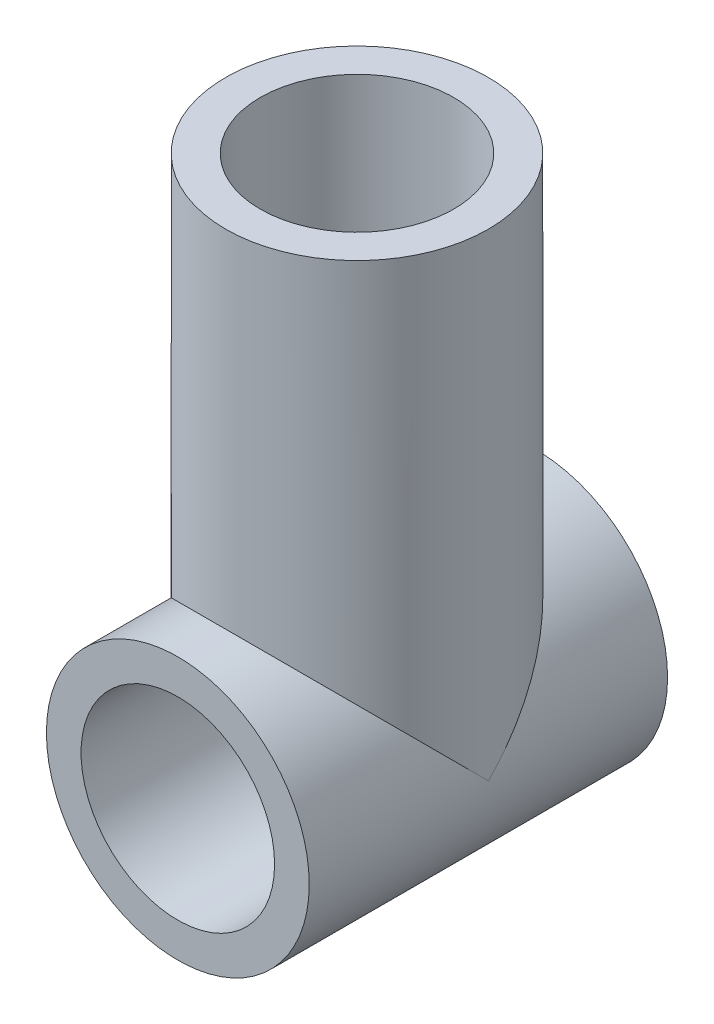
ISO-10303-21;
HEADER;
FILE_DESCRIPTION(('STEP AP214'),'2;1');
FILE_NAME('part.step','',(''),(''),'','','');
FILE_SCHEMA(('AUTOMOTIVE_DESIGN { 1 0 10303 214 1 1 1 1 }'));
ENDSEC;
DATA;
#1=APPLICATION_CONTEXT('core data for automotive mechanical design processes');
#2=APPLICATION_PROTOCOL_DEFINITION('international standard','automotive_design',2000,#1);
#3=PRODUCT_CONTEXT('',#1,'mechanical');
#4=PRODUCT('Part','Part','',(#3));
#5=PRODUCT_RELATED_PRODUCT_CATEGORY('part','',(#4));
#6=PRODUCT_DEFINITION_FORMATION('','',#4);
#7=PRODUCT_DEFINITION_CONTEXT('part definition',#1,'design');
#8=PRODUCT_DEFINITION('design','',#6,#7);
#9=PRODUCT_DEFINITION_SHAPE('','',#8);
#10=(LENGTH_UNIT() NAMED_UNIT(*) SI_UNIT(.MILLI.,.METRE.));
#11=(NAMED_UNIT(*) PLANE_ANGLE_UNIT() SI_UNIT($,.RADIAN.));
#12=(NAMED_UNIT(*) SI_UNIT($,.STERADIAN.) SOLID_ANGLE_UNIT());
#13=UNCERTAINTY_MEASURE_WITH_UNIT(LENGTH_MEASURE(1.E-05),#10,'distance_accuracy_value','');
#14=(GEOMETRIC_REPRESENTATION_CONTEXT(3) GLOBAL_UNCERTAINTY_ASSIGNED_CONTEXT((#13)) GLOBAL_UNIT_ASSIGNED_CONTEXT((#10,
#11,#12)) REPRESENTATION_CONTEXT('',''));
#15=CARTESIAN_POINT('',(0.,0.,0.));
#16=DIRECTION('',(0.,0.,1.));
#17=DIRECTION('',(1.,0.,0.));
#18=AXIS2_PLACEMENT_3D('',#15,#16,#17);
#19=CARTESIAN_POINT('',(0.,0.,30.));
#20=DIRECTION('',(0.,0.,-1.));
#21=DIRECTION('',(-1.,0.,0.));
#22=AXIS2_PLACEMENT_3D('',#19,#20,#21);
#23=CYLINDRICAL_SURFACE('',#22,11.);
#24=CARTESIAN_POINT('',(0.,0.,0.));
#25=DIRECTION('',(0.,0.,1.));
#26=DIRECTION('',(1.,0.,0.));
#27=AXIS2_PLACEMENT_3D('',#24,#25,#26);
#28=CIRCLE('',#27,11.);
#29=CARTESIAN_POINT('',(11.,0.,0.));
#30=VERTEX_POINT('',#29);
#31=EDGE_CURVE('E93',#30,#30,#28,.T.);
#32=ORIENTED_EDGE('',*,*,#31,.T.);
#33=EDGE_LOOP('',(#32));
#34=FACE_BOUND('',#33,.T.);
#35=CARTESIAN_POINT('',(0.,0.,30.));
#36=DIRECTION('',(0.,0.,1.));
#37=DIRECTION('',(1.,0.,0.));
#38=AXIS2_PLACEMENT_3D('',#35,#36,#37);
#39=CIRCLE('',#38,11.);
#40=CARTESIAN_POINT('',(11.,0.,30.));
#41=VERTEX_POINT('',#40);
#42=EDGE_CURVE('E94',#41,#41,#39,.T.);
#43=ORIENTED_EDGE('',*,*,#42,.F.);
#44=EDGE_LOOP('',(#43));
#45=FACE_BOUND('',#44,.T.);
#46=CARTESIAN_POINT('',(0.,0.,15.));
#47=DIRECTION('',(0.,-0.707106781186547,-0.707106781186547));
#48=DIRECTION('',(0.,0.707106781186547,-0.707106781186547));
#49=AXIS2_PLACEMENT_3D('',#46,#47,#48);
#50=ELLIPSE('',#49,15.556349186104,11.);
#51=CARTESIAN_POINT('',(11.,0.,15.));
#52=VERTEX_POINT('',#51);
#53=CARTESIAN_POINT('',(-11.,0.,15.));
#54=VERTEX_POINT('',#53);
#55=EDGE_CURVE('E66',#52,#54,#50,.F.);
#56=ORIENTED_EDGE('',*,*,#55,.F.);
#57=CARTESIAN_POINT('',(0.,0.,15.));
#58=DIRECTION('',(0.,0.707106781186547,-0.707106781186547));
#59=DIRECTION('',(0.,-0.707106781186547,-0.707106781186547));
#60=AXIS2_PLACEMENT_3D('',#57,#58,#59);
#61=ELLIPSE('',#60,15.556349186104,11.);
#62=EDGE_CURVE('E58',#54,#52,#61,.T.);
#63=ORIENTED_EDGE('',*,*,#62,.F.);
#64=EDGE_LOOP('',(#56,#63));
#65=FACE_BOUND('',#64,.T.);
#66=ADVANCED_FACE('F39',(#34,#45,#65),#23,.T.);
#67=CARTESIAN_POINT('',(0.,0.,30.));
#68=DIRECTION('',(0.,0.,1.));
#69=DIRECTION('',(1.,0.,0.));
#70=AXIS2_PLACEMENT_3D('',#67,#68,#69);
#71=PLANE('',#70);
#72=CARTESIAN_POINT('',(0.,0.,30.));
#73=DIRECTION('',(0.,0.,1.));
#74=DIRECTION('',(1.,0.,0.));
#75=AXIS2_PLACEMENT_3D('',#72,#73,#74);
#76=CIRCLE('',#75,8.1);
#77=CARTESIAN_POINT('',(8.1,0.,30.));
#78=VERTEX_POINT('',#77);
#79=EDGE_CURVE('E78',#78,#78,#76,.T.);
#80=ORIENTED_EDGE('',*,*,#79,.F.);
#81=EDGE_LOOP('',(#80));
#82=FACE_BOUND('',#81,.T.);
#83=ORIENTED_EDGE('',*,*,#42,.T.);
#84=EDGE_LOOP('',(#83));
#85=FACE_BOUND('',#84,.T.);
#86=ADVANCED_FACE('F107',(#82,#85),#71,.T.);
#87=CARTESIAN_POINT('',(0.,0.,0.));
#88=DIRECTION('',(0.,0.,1.));
#89=DIRECTION('',(1.,0.,0.));
#90=AXIS2_PLACEMENT_3D('',#87,#88,#89);
#91=PLANE('',#90);
#92=CARTESIAN_POINT('',(0.,0.,0.));
#93=DIRECTION('',(0.,0.,1.));
#94=DIRECTION('',(1.,0.,0.));
#95=AXIS2_PLACEMENT_3D('',#92,#93,#94);
#96=CIRCLE('',#95,8.1);
#97=CARTESIAN_POINT('',(8.1,0.,0.));
#98=VERTEX_POINT('',#97);
#99=EDGE_CURVE('E75',#98,#98,#96,.T.);
#100=ORIENTED_EDGE('',*,*,#99,.T.);
#101=EDGE_LOOP('',(#100));
#102=FACE_BOUND('',#101,.T.);
#103=ORIENTED_EDGE('',*,*,#31,.F.);
#104=EDGE_LOOP('',(#103));
#105=FACE_BOUND('',#104,.T.);
#106=ADVANCED_FACE('F112',(#102,#105),#91,.F.);
#107=CARTESIAN_POINT('',(0.,40.,15.));
#108=DIRECTION('',(0.,-1.,0.));
#109=DIRECTION('',(0.,0.,-1.));
#110=AXIS2_PLACEMENT_3D('',#107,#108,#109);
#111=CYLINDRICAL_SURFACE('',#110,11.);
#112=CARTESIAN_POINT('',(0.,40.,15.));
#113=DIRECTION('',(0.,1.,0.));
#114=DIRECTION('',(0.,0.,1.));
#115=AXIS2_PLACEMENT_3D('',#112,#113,#114);
#116=CIRCLE('',#115,11.);
#117=CARTESIAN_POINT('',(0.,40.,26.));
#118=VERTEX_POINT('',#117);
#119=EDGE_CURVE('E89',#118,#118,#116,.T.);
#120=ORIENTED_EDGE('',*,*,#119,.F.);
#121=EDGE_LOOP('',(#120));
#122=FACE_BOUND('',#121,.T.);
#123=ORIENTED_EDGE('',*,*,#62,.T.);
#124=ORIENTED_EDGE('',*,*,#55,.T.);
#125=EDGE_LOOP('',(#123,#124));
#126=FACE_BOUND('',#125,.T.);
#127=ADVANCED_FACE('F105',(#122,#126),#111,.T.);
#128=CARTESIAN_POINT('',(0.,40.,15.));
#129=DIRECTION('',(0.,-1.,0.));
#130=DIRECTION('',(0.,0.,-1.));
#131=AXIS2_PLACEMENT_3D('',#128,#129,#130);
#132=CYLINDRICAL_SURFACE('',#131,8.1);
#133=CARTESIAN_POINT('',(0.,40.,15.));
#134=DIRECTION('',(0.,1.,0.));
#135=DIRECTION('',(0.,0.,1.));
#136=AXIS2_PLACEMENT_3D('',#133,#134,#135);
#137=CIRCLE('',#136,8.1);
#138=CARTESIAN_POINT('',(0.,40.,23.1));
#139=VERTEX_POINT('',#138);
#140=EDGE_CURVE('E83',#139,#139,#137,.T.);
#141=ORIENTED_EDGE('',*,*,#140,.T.);
#142=EDGE_LOOP('',(#141));
#143=FACE_BOUND('',#142,.T.);
#144=CARTESIAN_POINT('',(0.,0.,15.));
#145=DIRECTION('',(0.,-0.707106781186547,0.707106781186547));
#146=DIRECTION('',(0.,0.707106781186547,0.707106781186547));
#147=AXIS2_PLACEMENT_3D('',#144,#145,#146);
#148=ELLIPSE('',#147,11.4551298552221,8.1);
#149=CARTESIAN_POINT('',(-8.1,0.,15.));
#150=VERTEX_POINT('',#149);
#151=CARTESIAN_POINT('',(8.1,0.,15.));
#152=VERTEX_POINT('',#151);
#153=EDGE_CURVE('E47',#150,#152,#148,.F.);
#154=ORIENTED_EDGE('',*,*,#153,.F.);
#155=CARTESIAN_POINT('',(0.,0.,15.));
#156=DIRECTION('',(0.,0.707106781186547,0.707106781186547));
#157=DIRECTION('',(0.,-0.707106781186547,0.707106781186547));
#158=AXIS2_PLACEMENT_3D('',#155,#156,#157);
#159=ELLIPSE('',#158,11.4551298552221,8.1);
#160=EDGE_CURVE('E11',#152,#150,#159,.T.);
#161=ORIENTED_EDGE('',*,*,#160,.F.);
#162=EDGE_LOOP('',(#154,#161));
#163=FACE_BOUND('',#162,.T.);
#164=ADVANCED_FACE('F63',(#143,#163),#132,.F.);
#165=CARTESIAN_POINT('',(0.,40.,15.));
#166=DIRECTION('',(0.,1.,0.));
#167=DIRECTION('',(0.,0.,1.));
#168=AXIS2_PLACEMENT_3D('',#165,#166,#167);
#169=PLANE('',#168);
#170=ORIENTED_EDGE('',*,*,#119,.T.);
#171=EDGE_LOOP('',(#170));
#172=FACE_BOUND('',#171,.T.);
#173=ORIENTED_EDGE('',*,*,#140,.F.);
#174=EDGE_LOOP('',(#173));
#175=FACE_BOUND('',#174,.T.);
#176=ADVANCED_FACE('F70',(#172,#175),#169,.T.);
#177=CARTESIAN_POINT('',(0.,0.,0.));
#178=DIRECTION('',(0.,0.,1.));
#179=DIRECTION('',(1.,0.,0.));
#180=AXIS2_PLACEMENT_3D('',#177,#178,#179);
#181=CYLINDRICAL_SURFACE('',#180,8.1);
#182=ORIENTED_EDGE('',*,*,#153,.T.);
#183=ORIENTED_EDGE('',*,*,#160,.T.);
#184=EDGE_LOOP('',(#182,#183));
#185=FACE_BOUND('',#184,.T.);
#186=ORIENTED_EDGE('',*,*,#99,.F.);
#187=EDGE_LOOP('',(#186));
#188=FACE_BOUND('',#187,.T.);
#189=ORIENTED_EDGE('',*,*,#79,.T.);
#190=EDGE_LOOP('',(#189));
#191=FACE_BOUND('',#190,.T.);
#192=ADVANCED_FACE('F67',(#185,#188,#191),#181,.F.);
#193=CLOSED_SHELL('',(#66,#86,#106,#127,#164,#176,#192));
#194=MANIFOLD_SOLID_BREP('B2',#193);
#195=ADVANCED_BREP_SHAPE_REPRESENTATION('',(#18,#194),#14);
#196=SHAPE_DEFINITION_REPRESENTATION(#9,#195);
ENDSEC;
END-ISO-10303-21;
